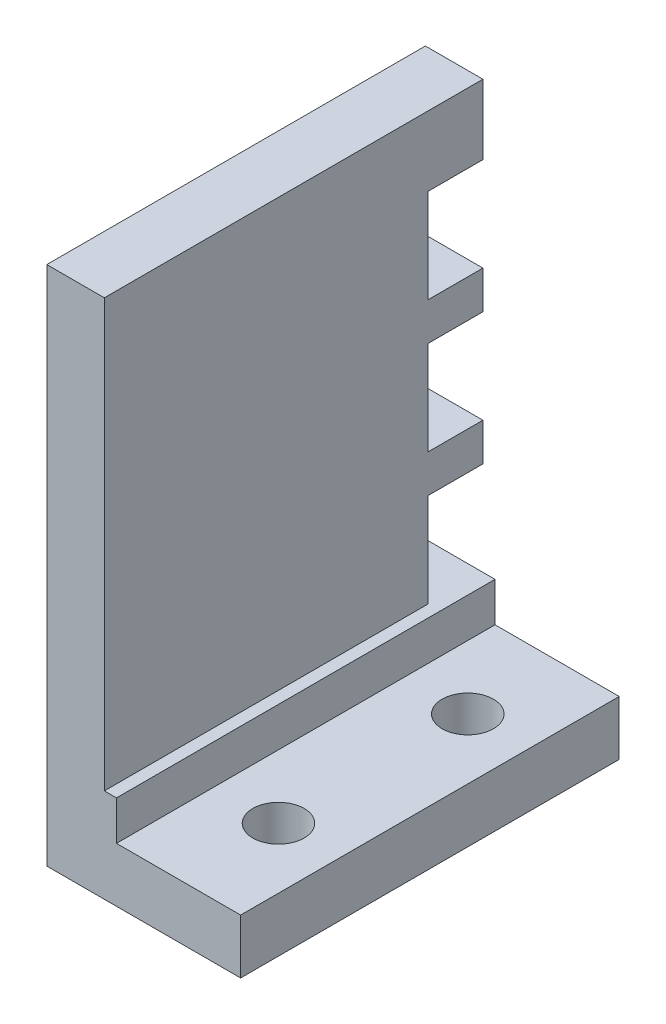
from build123d import *

# Parameters (mm, degrees)
BOSS_EXTRUDE1_DEPTH   = 31.75
F_6_CLEARANCE_HOLE1_D = 4.3053
CUT_EXTRUDE1_REACH    = 57.203
SKETCH5_W             = 4.6228
SKETCH5_H             = 7.874


with BuildPart() as part:
    # Sketch1 → Boss-Extrude1 (new body)
    with BuildSketch(Plane.XY):
        Polygon((0, 43.688), (0, 0), (16.256, 0), (16.256, 4.572), (5.842, 4.572), (5.842, 7.874), (4.826, 7.874), (4.826, 43.688), align=None)
    extrude(amount=BOSS_EXTRUDE1_DEPTH)

    # 6 Clearance Hole1 (through all)
    with Locations(Plane(origin=(0, 0, 0), x_dir=(-1, 0, 0), z_dir=(0, -1, 0))):
        with Locations((-11.176, -23.495), (-11.176, -7.62)):
            Hole(F_6_CLEARANCE_HOLE1_D / 2)

    # Sketch5 → Cut-Extrude1 (cut, up to next)
    with BuildSketch(Plane(origin=(4.826, 0, 0), x_dir=(0, 0, -1), z_dir=(1, 0, 0)), mode=Mode.PRIVATE) as cut_extrude1_sk1:
        with Locations((-2.3114, 33.909)):
            Rectangle(SKETCH5_W, SKETCH5_H)
    cut_extrude1_tool1 = extrude(cut_extrude1_sk1.sketch, amount=-CUT_EXTRUDE1_REACH, mode=Mode.PRIVATE) & part.part
    # Sketch5 → Cut-Extrude1 (cut, up to next)
    with BuildSketch(Plane(origin=(4.826, 0, 0), x_dir=(0, 0, -1), z_dir=(1, 0, 0)), mode=Mode.PRIVATE) as cut_extrude1_sk2:
        with Locations((-2.3114, 22.86)):
            Rectangle(SKETCH5_W, SKETCH5_H)
    cut_extrude1_tool2 = extrude(cut_extrude1_sk2.sketch, amount=-CUT_EXTRUDE1_REACH, mode=Mode.PRIVATE) & part.part
    # Sketch5 → Cut-Extrude1 (cut, up to next)
    with BuildSketch(Plane(origin=(4.826, 0, 0), x_dir=(0, 0, -1), z_dir=(1, 0, 0)), mode=Mode.PRIVATE) as cut_extrude1_sk3:
        with Locations((-2.3114, 11.811)):
            Rectangle(SKETCH5_W, SKETCH5_H)
    cut_extrude1_tool3 = extrude(cut_extrude1_sk3.sketch, amount=-CUT_EXTRUDE1_REACH, mode=Mode.PRIVATE) & part.part
    add(cut_extrude1_tool1.solids().sort_by_distance((4.826, 33.909, 2.3114))[0], mode=Mode.SUBTRACT)
    add(cut_extrude1_tool2.solids().sort_by_distance((4.826, 22.86, 2.3114))[0], mode=Mode.SUBTRACT)
    add(cut_extrude1_tool3.solids().sort_by_distance((4.826, 11.811, 2.3114))[0], mode=Mode.SUBTRACT)


solid = part.part
